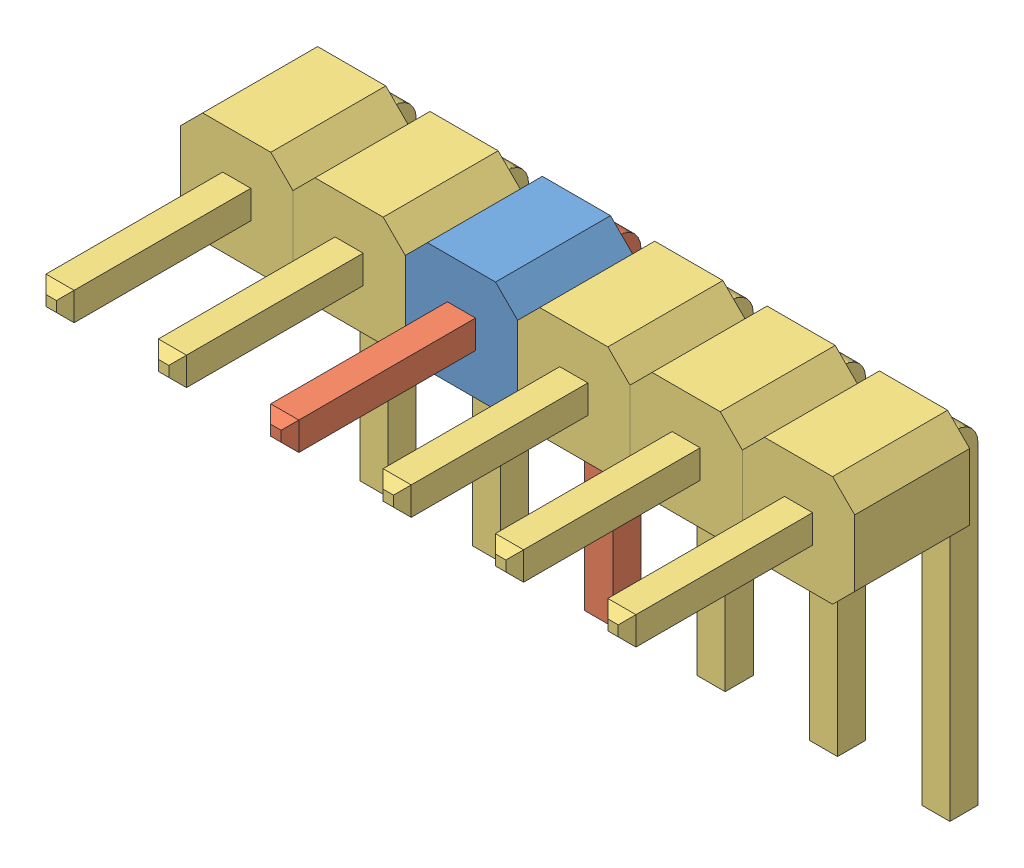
SolidWorks assembly HeaderMale x 6.SLDASM, configuration Predeterminado (file format 11000). Lengths in mm.
Overall size (15.25 8.73 7.94).
7 component instances, 3 part files, 14 mates.
Components (placement in the parent):
- pinB-1: pinB.SLDPRT [Predeterminado] at (-1.4403 1.348 1.3) size (2.54 2.5 2.6)
- pinA-1: pinA.SLDPRT [Predeterminado] at (-0.4878 -7.384 0.1595) size (0.64 7.8 7.94)
- HeaderMalePart-1: HeaderMalePart.SLDPRT [Predeterminado] at (-2.541 0 0) size (2.54 8.73 7.94)
- HeaderMalePart-2: HeaderMalePart.SLDPRT [Predeterminado] at (2.541 0 0) size (2.54 8.73 7.94)
- HeaderMalePart-3: HeaderMalePart.SLDPRT [Predeterminado] at (5.082 0 0) size (2.54 8.73 7.94)
- HeaderMalePart-4: HeaderMalePart.SLDPRT [Predeterminado] at (-5.082 0 0) size (2.54 8.73 7.94)
- HeaderMalePart-5: HeaderMalePart.SLDPRT [Predeterminado] at (7.623 0 0) size (2.54 8.73 7.94)
Mates (geometry in assembly coordinates):
- Coincidente1: coincident: plane of pinB-1 through (0.1482 0.416 3.9) normal (-1 0 0); plane of pinA-1 through (0.1482 0.416 0.1595) normal (1 0 0)
- Coincidente2: coincident: plane of pinB-1 through (-0.4878 -0.22 3.9) normal (0 1 0); plane of pinA-1 through (-0.4878 -0.22 8.0955) normal (0 -1 0)
- Distancia1: distance = 0.5045 mm: plane of pinB-1 through (-1.4403 1.348 1.3) normal (0 0 -1); plane of pinA-1 through (-0.4878 0.416 0.7955) normal (0 0 1)
- Coïncidente1: coincident: plane of HeaderMalePart-3 through (6.1827 1.348 4.5866) normal (1 0 0); plane of HeaderMalePart-5 through (6.1827 1.348 4.5866) normal (-1 0 0)
- Coïncidente3: coincident: line of HeaderMalePart-3 through (6.1827 -0.652 3.9) axis (0 0 -1); line of HeaderMalePart-5 through (6.1827 -0.652 1.3) axis (0 0 1)
- Coïncidente4: coincident: line of HeaderMalePart-3 through (6.1827 -0.652 1.3) axis (0 1 0); line of HeaderMalePart-5 through (6.1827 0.848 1.3) axis (0 -1 0)
- Coïncidente5: coincident: line of HeaderMalePart-2 through (3.6417 -0.652 1.3) axis (0 1 0); line of HeaderMalePart-3 through (3.6417 0.848 1.3) axis (0 -1 0)
- Coïncidente6: coincident: line of HeaderMalePart-2 through (3.6417 -0.652 3.9) axis (0 0 -1); line of HeaderMalePart-3 through (3.6417 -0.652 1.3) axis (0 0 1)
- Coïncidente7: coincident: line of pinB-1 through (1.1007 -0.652 3.9) axis (0 0 -1); line of HeaderMalePart-2 through (1.1007 -0.652 1.3) axis (0 0 1)
- Coïncidente8: coincident: line of pinB-1 through (1.1007 -0.652 1.3) axis (0 1 0); line of HeaderMalePart-2 through (1.1007 0.848 1.3) axis (0 -1 0)
- Coïncidente9: coincident: line of pinB-1 through (-1.4403 -0.652 1.3) axis (0 0 1); line of HeaderMalePart-1 through (-1.4403 -0.652 3.9) axis (0 0 -1)
- Coïncidente10: coincident: line of pinB-1 through (-1.4403 0.848 1.3) axis (0 -1 0); line of HeaderMalePart-1 through (-1.4403 -0.652 1.3) axis (0 1 0)
- Coïncidente11: coincident: line of HeaderMalePart-1 through (-3.9813 0.848 3.9) axis (0 0 -1); line of HeaderMalePart-4 through (-3.9813 0.848 1.3) axis (0 0 1)
- Coïncidente12: coincident: line of HeaderMalePart-1 through (-3.9813 0.848 1.3) axis (0 -1 0); moEndPointRef_w of HeaderMalePart-4
